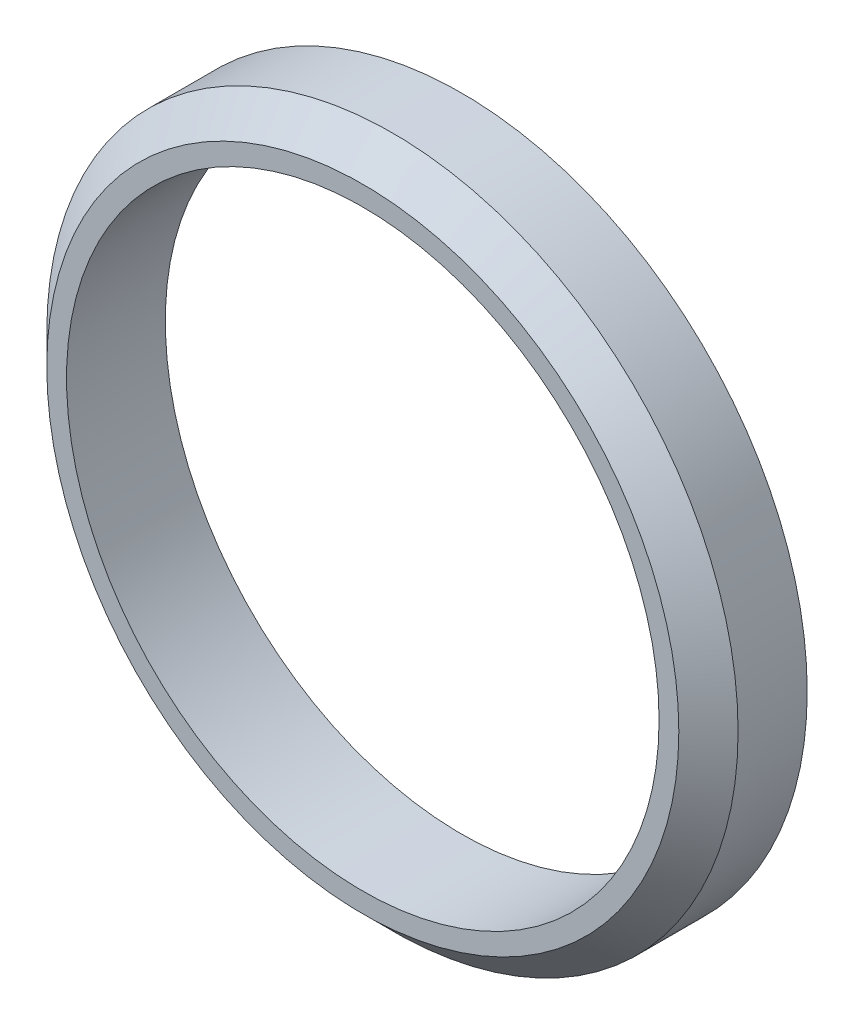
from build123d import *

# Parameters (mm, degrees)
SKETCH_1_R      = 35
SKETCH_1_R_2    = 30
EXTRUDE_1_DEPTH = 10
CHAMFER_1_SIZE  = 3


with BuildPart() as part:
    # Sketch 1 → Extrude 1 (new body)
    with BuildSketch(Plane.XY):
        Circle(SKETCH_1_R)
        Circle(SKETCH_1_R_2, mode=Mode.SUBTRACT)
    extrude(amount=EXTRUDE_1_DEPTH)

    # Chamfer 1
    chamfer_1_edges = [part.edges().sort_by_distance(p)[0] for p in [
        (-35, 0, 10),
    ]]
    chamfer(chamfer_1_edges, length=CHAMFER_1_SIZE)


solid = part.part
